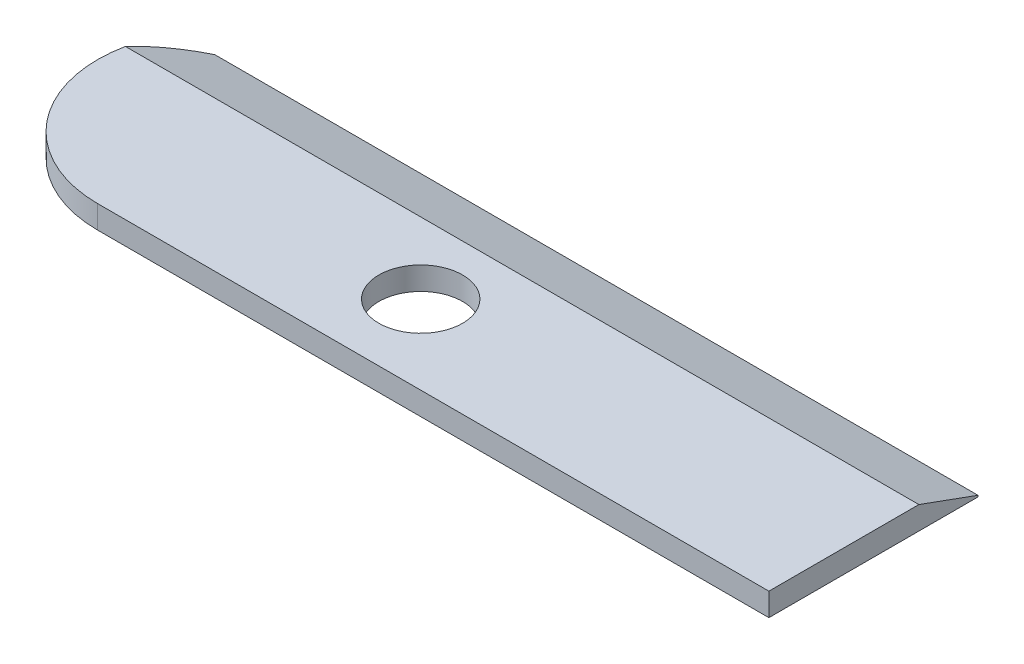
from build123d import *

# Parameters (mm, degrees)
SKETCH1_R          = 1.275
BLADE_DEPTH        = 0.7
CUTTING_EDGE_SIZE  = 1.8
CUTTING_EDGE_SIZE2 = 0.655146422


with BuildPart() as part:
    # Sketch1 → Blade (new body)
    with BuildSketch(Plane(origin=(0, 0, 0), x_dir=(1, 0, 0), z_dir=(0, 1, 0))):
        with BuildLine():
            Line((-15.042600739, 20.812404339), (-15.042600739, 14.445962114))
            Line((-15.042600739, 14.445962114), (-35.477439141, 14.445962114))
            ThreePointArc((-35.477439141, 14.445962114), (-38.955404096, 16.715027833), (-38.279826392, 20.812404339))
            Line((-38.279826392, 20.812404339), (-15.042600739, 20.812404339))
        make_face()
        with Locations(Location((-28.042600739, 16.845962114, 0), (0, 0, 270))):
            Circle(SKETCH1_R, mode=Mode.SUBTRACT)
    extrude(amount=BLADE_DEPTH)

    # cutting edge
    cutting_edge_edges = [part.edges().sort_by_distance(p)[0] for p in [
        (-26.661213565, 0.7, -20.812404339),
    ]]
    cutting_edge_side = [part.faces().sort_by_distance(p)[0] for p in [
        (-26.823274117, 0.7, -17.69236269),
    ]]
    chamfer(cutting_edge_edges, length=CUTTING_EDGE_SIZE, length2=CUTTING_EDGE_SIZE2, reference=cutting_edge_side[0])


solid = part.part
